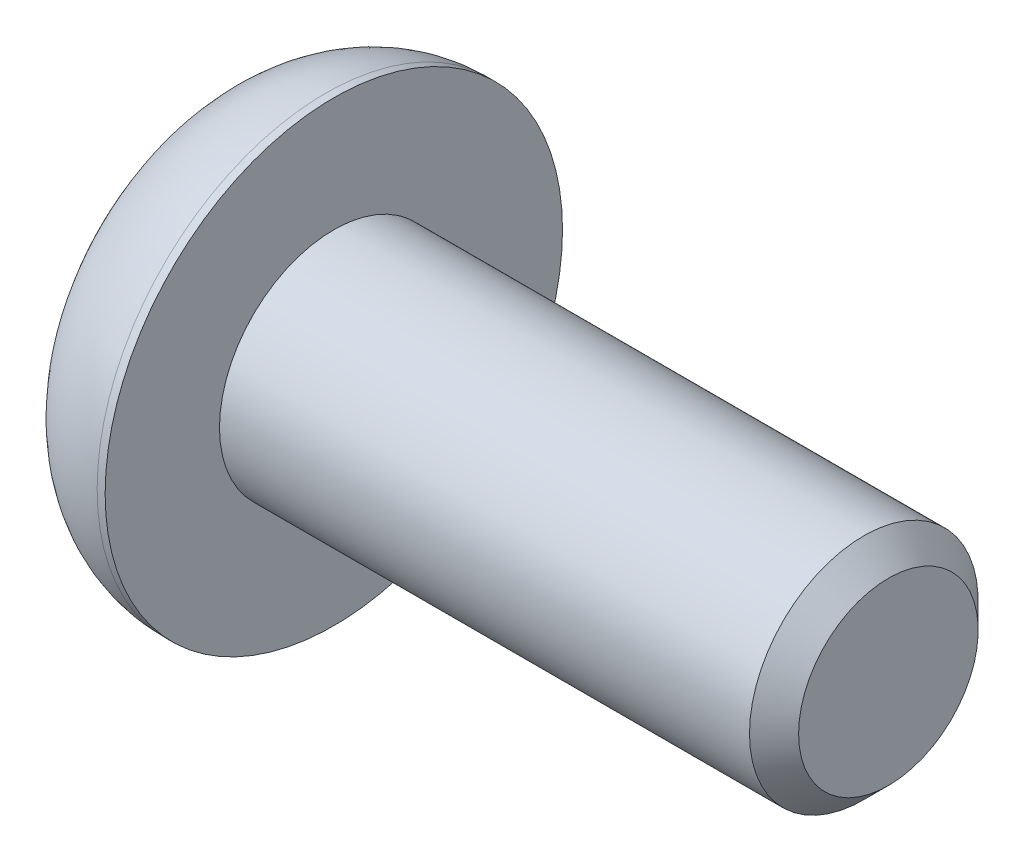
ISO-10303-21;
HEADER;
FILE_DESCRIPTION(('STEP AP214'),'2;1');
FILE_NAME('part.step','',(''),(''),'','','');
FILE_SCHEMA(('AUTOMOTIVE_DESIGN { 1 0 10303 214 1 1 1 1 }'));
ENDSEC;
DATA;
#1=APPLICATION_CONTEXT('core data for automotive mechanical design processes');
#2=APPLICATION_PROTOCOL_DEFINITION('international standard','automotive_design',2000,#1);
#3=PRODUCT_CONTEXT('',#1,'mechanical');
#4=PRODUCT('Part','Part','',(#3));
#5=PRODUCT_RELATED_PRODUCT_CATEGORY('part','',(#4));
#6=PRODUCT_DEFINITION_FORMATION('','',#4);
#7=PRODUCT_DEFINITION_CONTEXT('part definition',#1,'design');
#8=PRODUCT_DEFINITION('design','',#6,#7);
#9=PRODUCT_DEFINITION_SHAPE('','',#8);
#10=(LENGTH_UNIT() NAMED_UNIT(*) SI_UNIT(.MILLI.,.METRE.));
#11=(NAMED_UNIT(*) PLANE_ANGLE_UNIT() SI_UNIT($,.RADIAN.));
#12=(NAMED_UNIT(*) SI_UNIT($,.STERADIAN.) SOLID_ANGLE_UNIT());
#13=UNCERTAINTY_MEASURE_WITH_UNIT(LENGTH_MEASURE(1.E-05),#10,'distance_accuracy_value','');
#14=(GEOMETRIC_REPRESENTATION_CONTEXT(3) GLOBAL_UNCERTAINTY_ASSIGNED_CONTEXT((#13)) GLOBAL_UNIT_ASSIGNED_CONTEXT((#10,
#11,#12)) REPRESENTATION_CONTEXT('',''));
#15=CARTESIAN_POINT('',(0.,0.,0.));
#16=DIRECTION('',(0.,0.,1.));
#17=DIRECTION('',(1.,0.,0.));
#18=AXIS2_PLACEMENT_3D('',#15,#16,#17);
#19=CARTESIAN_POINT('',(1.495,0.721687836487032,1.25));
#20=DIRECTION('',(1.,0.,0.));
#21=DIRECTION('',(0.,0.,-1.));
#22=AXIS2_PLACEMENT_3D('',#19,#20,#21);
#23=PLANE('',#22);
#24=CARTESIAN_POINT('',(1.495,0.,0.));
#25=DIRECTION('',(1.,0.,0.));
#26=DIRECTION('',(0.,0.,-1.));
#27=AXIS2_PLACEMENT_3D('',#24,#25,#26);
#28=CIRCLE('',#27,1.25);
#29=CARTESIAN_POINT('',(1.495,0.,-1.25));
#30=VERTEX_POINT('',#29);
#31=CARTESIAN_POINT('',(1.495,-1.08253175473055,-0.625));
#32=VERTEX_POINT('',#31);
#33=EDGE_CURVE('E11',#30,#32,#28,.F.);
#34=ORIENTED_EDGE('',*,*,#33,.F.);
#35=DIRECTION('',(0.,1.,0.));
#36=VECTOR('',#35,1.);
#37=CARTESIAN_POINT('',(1.495,-0.721687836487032,-1.25));
#38=LINE('',#37,#36);
#39=CARTESIAN_POINT('',(1.495,-0.721687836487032,-1.25));
#40=VERTEX_POINT('',#39);
#41=EDGE_CURVE('E155',#40,#30,#38,.T.);
#42=ORIENTED_EDGE('',*,*,#41,.F.);
#43=DIRECTION('',(0.,0.5,-0.866025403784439));
#44=VECTOR('',#43,1.);
#45=CARTESIAN_POINT('',(1.495,-1.44337567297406,0.));
#46=LINE('',#45,#44);
#47=EDGE_CURVE('E407',#32,#40,#46,.T.);
#48=ORIENTED_EDGE('',*,*,#47,.F.);
#49=EDGE_LOOP('',(#34,#42,#48));
#50=FACE_BOUND('',#49,.T.);
#51=ADVANCED_FACE('F32',(#50),#23,.F.);
#52=CARTESIAN_POINT('',(1.495,-1.08253175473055,0.625));
#53=VERTEX_POINT('',#52);
#54=EDGE_CURVE('E41',#32,#53,#28,.F.);
#55=ORIENTED_EDGE('',*,*,#54,.F.);
#56=CARTESIAN_POINT('',(1.495,-1.44337567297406,0.));
#57=VERTEX_POINT('',#56);
#58=EDGE_CURVE('E408',#57,#32,#46,.T.);
#59=ORIENTED_EDGE('',*,*,#58,.F.);
#60=DIRECTION('',(0.,-0.5,-0.866025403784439));
#61=VECTOR('',#60,1.);
#62=CARTESIAN_POINT('',(1.495,-0.721687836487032,1.25));
#63=LINE('',#62,#61);
#64=EDGE_CURVE('E403',#53,#57,#63,.T.);
#65=ORIENTED_EDGE('',*,*,#64,.F.);
#66=EDGE_LOOP('',(#55,#59,#65));
#67=FACE_BOUND('',#66,.T.);
#68=ADVANCED_FACE('F117',(#67),#23,.F.);
#69=CARTESIAN_POINT('',(1.495,0.,1.25));
#70=VERTEX_POINT('',#69);
#71=EDGE_CURVE('E393',#53,#70,#28,.F.);
#72=ORIENTED_EDGE('',*,*,#71,.F.);
#73=CARTESIAN_POINT('',(1.495,-0.721687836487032,1.25));
#74=VERTEX_POINT('',#73);
#75=EDGE_CURVE('E399',#74,#53,#63,.T.);
#76=ORIENTED_EDGE('',*,*,#75,.F.);
#77=DIRECTION('',(0.,-1.,0.));
#78=VECTOR('',#77,1.);
#79=CARTESIAN_POINT('',(1.495,0.721687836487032,1.25));
#80=LINE('',#79,#78);
#81=EDGE_CURVE('E396',#70,#74,#80,.T.);
#82=ORIENTED_EDGE('',*,*,#81,.F.);
#83=EDGE_LOOP('',(#72,#76,#82));
#84=FACE_BOUND('',#83,.T.);
#85=ADVANCED_FACE('F124',(#84),#23,.F.);
#86=CARTESIAN_POINT('',(1.495,1.08253175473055,0.625));
#87=VERTEX_POINT('',#86);
#88=EDGE_CURVE('E388',#70,#87,#28,.F.);
#89=ORIENTED_EDGE('',*,*,#88,.F.);
#90=CARTESIAN_POINT('',(1.495,0.721687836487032,1.25));
#91=VERTEX_POINT('',#90);
#92=EDGE_CURVE('E391',#91,#70,#80,.T.);
#93=ORIENTED_EDGE('',*,*,#92,.F.);
#94=DIRECTION('',(0.,-0.5,0.866025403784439));
#95=VECTOR('',#94,1.);
#96=CARTESIAN_POINT('',(1.495,1.44337567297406,0.));
#97=LINE('',#96,#95);
#98=EDGE_CURVE('E176',#87,#91,#97,.T.);
#99=ORIENTED_EDGE('',*,*,#98,.F.);
#100=EDGE_LOOP('',(#89,#93,#99));
#101=FACE_BOUND('',#100,.T.);
#102=ADVANCED_FACE('F137',(#101),#23,.F.);
#103=CARTESIAN_POINT('',(1.495,1.08253175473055,-0.625));
#104=VERTEX_POINT('',#103);
#105=EDGE_CURVE('E48',#87,#104,#28,.F.);
#106=ORIENTED_EDGE('',*,*,#105,.F.);
#107=CARTESIAN_POINT('',(1.495,1.44337567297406,0.));
#108=VERTEX_POINT('',#107);
#109=EDGE_CURVE('E151',#108,#87,#97,.T.);
#110=ORIENTED_EDGE('',*,*,#109,.F.);
#111=DIRECTION('',(0.,0.5,0.866025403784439));
#112=VECTOR('',#111,1.);
#113=CARTESIAN_POINT('',(1.495,0.721687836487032,-1.25));
#114=LINE('',#113,#112);
#115=EDGE_CURVE('E148',#104,#108,#114,.T.);
#116=ORIENTED_EDGE('',*,*,#115,.F.);
#117=EDGE_LOOP('',(#106,#110,#116));
#118=FACE_BOUND('',#117,.T.);
#119=ADVANCED_FACE('F129',(#118),#23,.F.);
#120=EDGE_CURVE('E36',#104,#30,#28,.F.);
#121=ORIENTED_EDGE('',*,*,#120,.F.);
#122=CARTESIAN_POINT('',(1.495,0.721687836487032,-1.25));
#123=VERTEX_POINT('',#122);
#124=EDGE_CURVE('E143',#123,#104,#114,.T.);
#125=ORIENTED_EDGE('',*,*,#124,.F.);
#126=EDGE_CURVE('E144',#30,#123,#38,.T.);
#127=ORIENTED_EDGE('',*,*,#126,.F.);
#128=EDGE_LOOP('',(#121,#125,#127));
#129=FACE_BOUND('',#128,.T.);
#130=ADVANCED_FACE('F120',(#129),#23,.F.);
#131=CARTESIAN_POINT('',(0.,0.,0.));
#132=DIRECTION('',(1.,0.,0.));
#133=DIRECTION('',(0.,0.,-1.));
#134=AXIS2_PLACEMENT_3D('',#131,#132,#133);
#135=PLANE('',#134);
#136=CARTESIAN_POINT('',(0.,0.,0.));
#137=DIRECTION('',(-1.,0.,0.));
#138=DIRECTION('',(0.,0.,1.));
#139=AXIS2_PLACEMENT_3D('',#136,#137,#138);
#140=CIRCLE('',#139,1.84);
#141=CARTESIAN_POINT('',(0.,0.,1.84));
#142=VERTEX_POINT('',#141);
#143=EDGE_CURVE('E146',#142,#142,#140,.T.);
#144=ORIENTED_EDGE('',*,*,#143,.T.);
#145=EDGE_LOOP('',(#144));
#146=FACE_BOUND('',#145,.T.);
#147=DIRECTION('',(0.,-0.5,0.866025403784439));
#148=VECTOR('',#147,1.);
#149=CARTESIAN_POINT('',(0.,1.44337567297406,0.));
#150=LINE('',#149,#148);
#151=CARTESIAN_POINT('',(0.,1.44337567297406,0.));
#152=VERTEX_POINT('',#151);
#153=CARTESIAN_POINT('',(0.,0.721687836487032,1.25));
#154=VERTEX_POINT('',#153);
#155=EDGE_CURVE('E165',#152,#154,#150,.T.);
#156=ORIENTED_EDGE('',*,*,#155,.T.);
#157=DIRECTION('',(0.,-1.,0.));
#158=VECTOR('',#157,1.);
#159=CARTESIAN_POINT('',(0.,0.721687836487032,1.25));
#160=LINE('',#159,#158);
#161=CARTESIAN_POINT('',(0.,-0.721687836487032,1.25));
#162=VERTEX_POINT('',#161);
#163=EDGE_CURVE('E167',#154,#162,#160,.T.);
#164=ORIENTED_EDGE('',*,*,#163,.T.);
#165=DIRECTION('',(0.,-0.5,-0.866025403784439));
#166=VECTOR('',#165,1.);
#167=CARTESIAN_POINT('',(0.,-0.721687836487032,1.25));
#168=LINE('',#167,#166);
#169=CARTESIAN_POINT('',(0.,-1.44337567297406,0.));
#170=VERTEX_POINT('',#169);
#171=EDGE_CURVE('E170',#162,#170,#168,.T.);
#172=ORIENTED_EDGE('',*,*,#171,.T.);
#173=DIRECTION('',(0.,0.5,-0.866025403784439));
#174=VECTOR('',#173,1.);
#175=CARTESIAN_POINT('',(0.,-1.44337567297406,0.));
#176=LINE('',#175,#174);
#177=CARTESIAN_POINT('',(0.,-0.721687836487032,-1.25));
#178=VERTEX_POINT('',#177);
#179=EDGE_CURVE('E172',#170,#178,#176,.T.);
#180=ORIENTED_EDGE('',*,*,#179,.T.);
#181=DIRECTION('',(0.,1.,0.));
#182=VECTOR('',#181,1.);
#183=CARTESIAN_POINT('',(0.,-0.721687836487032,-1.25));
#184=LINE('',#183,#182);
#185=CARTESIAN_POINT('',(0.,0.721687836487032,-1.25));
#186=VERTEX_POINT('',#185);
#187=EDGE_CURVE('E174',#178,#186,#184,.T.);
#188=ORIENTED_EDGE('',*,*,#187,.T.);
#189=DIRECTION('',(0.,0.5,0.866025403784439));
#190=VECTOR('',#189,1.);
#191=CARTESIAN_POINT('',(0.,0.721687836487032,-1.25));
#192=LINE('',#191,#190);
#193=EDGE_CURVE('E56',#186,#152,#192,.T.);
#194=ORIENTED_EDGE('',*,*,#193,.T.);
#195=EDGE_LOOP('',(#156,#164,#172,#180,#188,#194));
#196=FACE_BOUND('',#195,.T.);
#197=ADVANCED_FACE('F34',(#146,#196),#135,.F.);
#198=CARTESIAN_POINT('',(2.16,0.,0.));
#199=DIRECTION('',(-1.,0.,0.));
#200=DIRECTION('',(0.,0.,1.));
#201=AXIS2_PLACEMENT_3D('',#198,#199,#200);
#202=DEGENERATE_TOROIDAL_SURFACE('',#201,1.84,2.16,.T.);
#203=ORIENTED_EDGE('',*,*,#143,.F.);
#204=EDGE_LOOP('',(#203));
#205=FACE_BOUND('',#204,.T.);
#206=CARTESIAN_POINT('',(2.16,0.,0.));
#207=DIRECTION('',(-1.,0.,0.));
#208=DIRECTION('',(0.,0.,1.));
#209=AXIS2_PLACEMENT_3D('',#206,#207,#208);
#210=CIRCLE('',#209,4.);
#211=CARTESIAN_POINT('',(2.16,0.,4.));
#212=VERTEX_POINT('',#211);
#213=EDGE_CURVE('E203',#212,#212,#210,.T.);
#214=ORIENTED_EDGE('',*,*,#213,.T.);
#215=EDGE_LOOP('',(#214));
#216=FACE_BOUND('',#215,.T.);
#217=ADVANCED_FACE('F135',(#205,#216),#202,.T.);
#218=CARTESIAN_POINT('',(12.,0.,0.));
#219=DIRECTION('',(-1.,0.,0.));
#220=DIRECTION('',(0.,0.,1.));
#221=AXIS2_PLACEMENT_3D('',#218,#219,#220);
#222=CYLINDRICAL_SURFACE('',#221,4.);
#223=ORIENTED_EDGE('',*,*,#213,.F.);
#224=EDGE_LOOP('',(#223));
#225=FACE_BOUND('',#224,.T.);
#226=CARTESIAN_POINT('',(2.3,0.,0.));
#227=DIRECTION('',(-1.,0.,0.));
#228=DIRECTION('',(0.,0.,1.));
#229=AXIS2_PLACEMENT_3D('',#226,#227,#228);
#230=CIRCLE('',#229,4.);
#231=CARTESIAN_POINT('',(2.3,0.,4.));
#232=VERTEX_POINT('',#231);
#233=EDGE_CURVE('E200',#232,#232,#230,.T.);
#234=ORIENTED_EDGE('',*,*,#233,.T.);
#235=EDGE_LOOP('',(#234));
#236=FACE_BOUND('',#235,.T.);
#237=ADVANCED_FACE('F210',(#225,#236),#222,.T.);
#238=CARTESIAN_POINT('',(2.3,4.,0.));
#239=DIRECTION('',(-1.,0.,0.));
#240=DIRECTION('',(0.,0.,1.));
#241=AXIS2_PLACEMENT_3D('',#238,#239,#240);
#242=PLANE('',#241);
#243=ORIENTED_EDGE('',*,*,#233,.F.);
#244=EDGE_LOOP('',(#243));
#245=FACE_BOUND('',#244,.T.);
#246=CARTESIAN_POINT('',(2.3,0.,0.));
#247=DIRECTION('',(-1.,0.,0.));
#248=DIRECTION('',(0.,0.,1.));
#249=AXIS2_PLACEMENT_3D('',#246,#247,#248);
#250=CIRCLE('',#249,2.);
#251=CARTESIAN_POINT('',(2.3,0.,2.));
#252=VERTEX_POINT('',#251);
#253=EDGE_CURVE('E197',#252,#252,#250,.T.);
#254=ORIENTED_EDGE('',*,*,#253,.T.);
#255=EDGE_LOOP('',(#254));
#256=FACE_BOUND('',#255,.T.);
#257=ADVANCED_FACE('F215',(#245,#256),#242,.F.);
#258=CARTESIAN_POINT('',(12.,0.,0.));
#259=DIRECTION('',(-1.,0.,0.));
#260=DIRECTION('',(0.,0.,1.));
#261=AXIS2_PLACEMENT_3D('',#258,#259,#260);
#262=CYLINDRICAL_SURFACE('',#261,2.);
#263=ORIENTED_EDGE('',*,*,#253,.F.);
#264=EDGE_LOOP('',(#263));
#265=FACE_BOUND('',#264,.T.);
#266=CARTESIAN_POINT('',(11.5705,0.,0.));
#267=DIRECTION('',(-1.,0.,0.));
#268=DIRECTION('',(0.,0.,1.));
#269=AXIS2_PLACEMENT_3D('',#266,#267,#268);
#270=CIRCLE('',#269,2.);
#271=CARTESIAN_POINT('',(11.5705,0.,2.));
#272=VERTEX_POINT('',#271);
#273=EDGE_CURVE('E194',#272,#272,#270,.T.);
#274=ORIENTED_EDGE('',*,*,#273,.T.);
#275=EDGE_LOOP('',(#274));
#276=FACE_BOUND('',#275,.T.);
#277=ADVANCED_FACE('F221',(#265,#276),#262,.T.);
#278=CARTESIAN_POINT('',(12.,0.,0.));
#279=DIRECTION('',(-1.,0.,0.));
#280=DIRECTION('',(0.,0.,1.));
#281=AXIS2_PLACEMENT_3D('',#278,#279,#280);
#282=CONICAL_SURFACE('',#281,1.5705,0.785398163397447);
#283=ORIENTED_EDGE('',*,*,#273,.F.);
#284=EDGE_LOOP('',(#283));
#285=FACE_BOUND('',#284,.T.);
#286=CARTESIAN_POINT('',(12.,0.,0.));
#287=DIRECTION('',(-1.,0.,0.));
#288=DIRECTION('',(0.,0.,1.));
#289=AXIS2_PLACEMENT_3D('',#286,#287,#288);
#290=CIRCLE('',#289,1.5705);
#291=CARTESIAN_POINT('',(12.,0.,1.5705));
#292=VERTEX_POINT('',#291);
#293=EDGE_CURVE('E191',#292,#292,#290,.T.);
#294=ORIENTED_EDGE('',*,*,#293,.T.);
#295=EDGE_LOOP('',(#294));
#296=FACE_BOUND('',#295,.T.);
#297=ADVANCED_FACE('F227',(#285,#296),#282,.T.);
#298=CARTESIAN_POINT('',(12.,1.5705,0.));
#299=DIRECTION('',(-1.,0.,0.));
#300=DIRECTION('',(0.,0.,1.));
#301=AXIS2_PLACEMENT_3D('',#298,#299,#300);
#302=PLANE('',#301);
#303=ORIENTED_EDGE('',*,*,#293,.F.);
#304=EDGE_LOOP('',(#303));
#305=FACE_BOUND('',#304,.T.);
#306=ADVANCED_FACE('F233',(#305),#302,.F.);
#307=CARTESIAN_POINT('',(1.495,1.44337567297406,0.));
#308=DIRECTION('',(0.,-0.866025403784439,-0.5));
#309=DIRECTION('',(0.,0.5,-0.866025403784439));
#310=AXIS2_PLACEMENT_3D('',#307,#308,#309);
#311=PLANE('',#310);
#312=ORIENTED_EDGE('',*,*,#109,.T.);
#313=ORIENTED_EDGE('',*,*,#98,.T.);
#314=DIRECTION('',(-1.,0.,0.));
#315=VECTOR('',#314,1.);
#316=CARTESIAN_POINT('',(1.495,0.721687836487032,1.25));
#317=LINE('',#316,#315);
#318=EDGE_CURVE('E188',#91,#154,#317,.T.);
#319=ORIENTED_EDGE('',*,*,#318,.T.);
#320=ORIENTED_EDGE('',*,*,#155,.F.);
#321=DIRECTION('',(-1.,0.,0.));
#322=VECTOR('',#321,1.);
#323=CARTESIAN_POINT('',(1.495,1.44337567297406,0.));
#324=LINE('',#323,#322);
#325=EDGE_CURVE('E160',#108,#152,#324,.T.);
#326=ORIENTED_EDGE('',*,*,#325,.F.);
#327=EDGE_LOOP('',(#312,#313,#319,#320,#326));
#328=FACE_BOUND('',#327,.T.);
#329=ADVANCED_FACE('F238',(#328),#311,.T.);
#330=CARTESIAN_POINT('',(1.495,0.721687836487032,1.25));
#331=DIRECTION('',(0.,0.,-1.));
#332=DIRECTION('',(-1.,0.,0.));
#333=AXIS2_PLACEMENT_3D('',#330,#331,#332);
#334=PLANE('',#333);
#335=ORIENTED_EDGE('',*,*,#92,.T.);
#336=ORIENTED_EDGE('',*,*,#81,.T.);
#337=DIRECTION('',(-1.,0.,0.));
#338=VECTOR('',#337,1.);
#339=CARTESIAN_POINT('',(1.495,-0.721687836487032,1.25));
#340=LINE('',#339,#338);
#341=EDGE_CURVE('E185',#74,#162,#340,.T.);
#342=ORIENTED_EDGE('',*,*,#341,.T.);
#343=ORIENTED_EDGE('',*,*,#163,.F.);
#344=ORIENTED_EDGE('',*,*,#318,.F.);
#345=EDGE_LOOP('',(#335,#336,#342,#343,#344));
#346=FACE_BOUND('',#345,.T.);
#347=ADVANCED_FACE('F243',(#346),#334,.T.);
#348=CARTESIAN_POINT('',(1.495,-0.721687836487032,1.25));
#349=DIRECTION('',(0.,0.866025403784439,-0.5));
#350=DIRECTION('',(0.,0.5,0.866025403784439));
#351=AXIS2_PLACEMENT_3D('',#348,#349,#350);
#352=PLANE('',#351);
#353=ORIENTED_EDGE('',*,*,#75,.T.);
#354=ORIENTED_EDGE('',*,*,#64,.T.);
#355=DIRECTION('',(-1.,0.,0.));
#356=VECTOR('',#355,1.);
#357=CARTESIAN_POINT('',(1.495,-1.44337567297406,0.));
#358=LINE('',#357,#356);
#359=EDGE_CURVE('E182',#57,#170,#358,.T.);
#360=ORIENTED_EDGE('',*,*,#359,.T.);
#361=ORIENTED_EDGE('',*,*,#171,.F.);
#362=ORIENTED_EDGE('',*,*,#341,.F.);
#363=EDGE_LOOP('',(#353,#354,#360,#361,#362));
#364=FACE_BOUND('',#363,.T.);
#365=ADVANCED_FACE('F249',(#364),#352,.T.);
#366=CARTESIAN_POINT('',(1.495,-1.44337567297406,0.));
#367=DIRECTION('',(0.,0.866025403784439,0.5));
#368=DIRECTION('',(0.,-0.5,0.866025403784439));
#369=AXIS2_PLACEMENT_3D('',#366,#367,#368);
#370=PLANE('',#369);
#371=ORIENTED_EDGE('',*,*,#58,.T.);
#372=ORIENTED_EDGE('',*,*,#47,.T.);
#373=DIRECTION('',(-1.,0.,0.));
#374=VECTOR('',#373,1.);
#375=CARTESIAN_POINT('',(1.495,-0.721687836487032,-1.25));
#376=LINE('',#375,#374);
#377=EDGE_CURVE('E179',#40,#178,#376,.T.);
#378=ORIENTED_EDGE('',*,*,#377,.T.);
#379=ORIENTED_EDGE('',*,*,#179,.F.);
#380=ORIENTED_EDGE('',*,*,#359,.F.);
#381=EDGE_LOOP('',(#371,#372,#378,#379,#380));
#382=FACE_BOUND('',#381,.T.);
#383=ADVANCED_FACE('F253',(#382),#370,.T.);
#384=CARTESIAN_POINT('',(1.495,-0.721687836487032,-1.25));
#385=DIRECTION('',(0.,0.,1.));
#386=DIRECTION('',(1.,0.,0.));
#387=AXIS2_PLACEMENT_3D('',#384,#385,#386);
#388=PLANE('',#387);
#389=ORIENTED_EDGE('',*,*,#41,.T.);
#390=ORIENTED_EDGE('',*,*,#126,.T.);
#391=DIRECTION('',(-1.,0.,0.));
#392=VECTOR('',#391,1.);
#393=CARTESIAN_POINT('',(1.495,0.721687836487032,-1.25));
#394=LINE('',#393,#392);
#395=EDGE_CURVE('E159',#123,#186,#394,.T.);
#396=ORIENTED_EDGE('',*,*,#395,.T.);
#397=ORIENTED_EDGE('',*,*,#187,.F.);
#398=ORIENTED_EDGE('',*,*,#377,.F.);
#399=EDGE_LOOP('',(#389,#390,#396,#397,#398));
#400=FACE_BOUND('',#399,.T.);
#401=ADVANCED_FACE('F257',(#400),#388,.T.);
#402=CARTESIAN_POINT('',(1.495,0.721687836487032,-1.25));
#403=DIRECTION('',(0.,-0.866025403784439,0.5));
#404=DIRECTION('',(0.,-0.5,-0.866025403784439));
#405=AXIS2_PLACEMENT_3D('',#402,#403,#404);
#406=PLANE('',#405);
#407=ORIENTED_EDGE('',*,*,#124,.T.);
#408=ORIENTED_EDGE('',*,*,#115,.T.);
#409=ORIENTED_EDGE('',*,*,#325,.T.);
#410=ORIENTED_EDGE('',*,*,#193,.F.);
#411=ORIENTED_EDGE('',*,*,#395,.F.);
#412=EDGE_LOOP('',(#407,#408,#409,#410,#411));
#413=FACE_BOUND('',#412,.T.);
#414=ADVANCED_FACE('F112',(#413),#406,.T.);
#415=CARTESIAN_POINT('',(2.3,0.,0.));
#416=DIRECTION('',(-1.,0.,0.));
#417=DIRECTION('',(0.,0.,1.));
#418=AXIS2_PLACEMENT_3D('',#415,#416,#417);
#419=CYLINDRICAL_SURFACE('',#418,1.25);
#420=CARTESIAN_POINT('',(1.57831216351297,0.,0.));
#421=DIRECTION('',(-1.,0.,0.));
#422=DIRECTION('',(0.,0.,1.));
#423=AXIS2_PLACEMENT_3D('',#420,#421,#422);
#424=CIRCLE('',#423,1.25);
#425=CARTESIAN_POINT('',(1.57831216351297,0.,1.25));
#426=VERTEX_POINT('',#425);
#427=EDGE_CURVE('E168',#426,#426,#424,.T.);
#428=ORIENTED_EDGE('',*,*,#427,.F.);
#429=EDGE_LOOP('',(#428));
#430=FACE_BOUND('',#429,.T.);
#431=ORIENTED_EDGE('',*,*,#33,.T.);
#432=ORIENTED_EDGE('',*,*,#54,.T.);
#433=ORIENTED_EDGE('',*,*,#71,.T.);
#434=ORIENTED_EDGE('',*,*,#88,.T.);
#435=ORIENTED_EDGE('',*,*,#105,.T.);
#436=ORIENTED_EDGE('',*,*,#120,.T.);
#437=EDGE_LOOP('',(#431,#432,#433,#434,#435,#436));
#438=FACE_BOUND('',#437,.T.);
#439=ADVANCED_FACE('F106',(#430,#438),#419,.F.);
#440=CARTESIAN_POINT('',(2.3,0.,0.));
#441=DIRECTION('',(-1.,0.,0.));
#442=DIRECTION('',(0.,0.,1.));
#443=AXIS2_PLACEMENT_3D('',#440,#441,#442);
#444=CONICAL_SURFACE('',#443,0.,1.0471975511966);
#445=ORIENTED_EDGE('',*,*,#427,.T.);
#446=EDGE_LOOP('',(#445));
#447=FACE_BOUND('',#446,.T.);
#448=CARTESIAN_POINT('',(2.3,0.,0.));
#449=VERTEX_POINT('',#448);
#450=VERTEX_LOOP('',#449);
#451=FACE_BOUND('',#450,.T.);
#452=ADVANCED_FACE('F104',(#447,#451),#444,.F.);
#453=CLOSED_SHELL('',(#51,#68,#85,#102,#119,#130,#197,#217,#237,#257,#277,#297,#306,#329,#347,
#365,#383,#401,#414,#439,#452));
#454=MANIFOLD_SOLID_BREP('B2',#453);
#455=ADVANCED_BREP_SHAPE_REPRESENTATION('',(#18,#454),#14);
#456=SHAPE_DEFINITION_REPRESENTATION(#9,#455);
ENDSEC;
END-ISO-10303-21;
